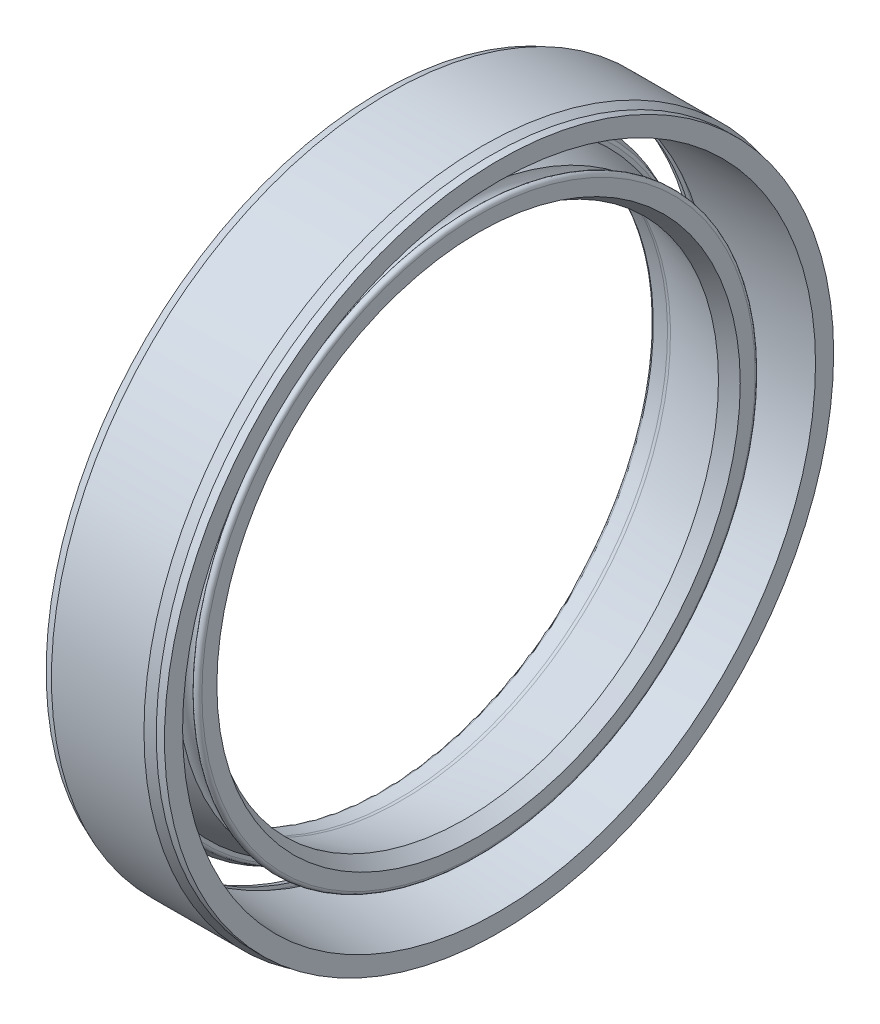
ISO-10303-21;
HEADER;
FILE_DESCRIPTION(('STEP AP214'),'2;1');
FILE_NAME('part.step','',(''),(''),'','','');
FILE_SCHEMA(('AUTOMOTIVE_DESIGN { 1 0 10303 214 1 1 1 1 }'));
ENDSEC;
DATA;
#1=APPLICATION_CONTEXT('core data for automotive mechanical design processes');
#2=APPLICATION_PROTOCOL_DEFINITION('international standard','automotive_design',2000,#1);
#3=PRODUCT_CONTEXT('',#1,'mechanical');
#4=PRODUCT('Part','Part','',(#3));
#5=PRODUCT_RELATED_PRODUCT_CATEGORY('part','',(#4));
#6=PRODUCT_DEFINITION_FORMATION('','',#4);
#7=PRODUCT_DEFINITION_CONTEXT('part definition',#1,'design');
#8=PRODUCT_DEFINITION('design','',#6,#7);
#9=PRODUCT_DEFINITION_SHAPE('','',#8);
#10=(LENGTH_UNIT() NAMED_UNIT(*) SI_UNIT(.MILLI.,.METRE.));
#11=(NAMED_UNIT(*) PLANE_ANGLE_UNIT() SI_UNIT($,.RADIAN.));
#12=(NAMED_UNIT(*) SI_UNIT($,.STERADIAN.) SOLID_ANGLE_UNIT());
#13=UNCERTAINTY_MEASURE_WITH_UNIT(LENGTH_MEASURE(1.E-05),#10,'distance_accuracy_value','');
#14=(GEOMETRIC_REPRESENTATION_CONTEXT(3) GLOBAL_UNCERTAINTY_ASSIGNED_CONTEXT((#13)) GLOBAL_UNIT_ASSIGNED_CONTEXT((#10,
#11,#12)) REPRESENTATION_CONTEXT('',''));
#15=CARTESIAN_POINT('',(0.,0.,0.));
#16=DIRECTION('',(0.,0.,1.));
#17=DIRECTION('',(1.,0.,0.));
#18=AXIS2_PLACEMENT_3D('',#15,#16,#17);
#19=CARTESIAN_POINT('',(-6.56875,0.,0.));
#20=DIRECTION('',(-1.,0.,0.));
#21=DIRECTION('',(0.,-1.,0.));
#22=AXIS2_PLACEMENT_3D('',#19,#20,#21);
#23=CONICAL_SURFACE('',#22,18.5539202,0.301266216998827);
#24=CARTESIAN_POINT('',(-7.,0.,0.));
#25=DIRECTION('',(-1.,0.,0.));
#26=DIRECTION('',(0.,-1.,0.));
#27=AXIS2_PLACEMENT_3D('',#24,#25,#26);
#28=CIRCLE('',#27,18.68792);
#29=CARTESIAN_POINT('',(-7.,-18.68792,0.));
#30=VERTEX_POINT('',#29);
#31=EDGE_CURVE('P0_E53',#30,#30,#28,.F.);
#32=ORIENTED_EDGE('',*,*,#31,.F.);
#33=EDGE_LOOP('',(#32));
#34=FACE_BOUND('',#33,.T.);
#35=CARTESIAN_POINT('',(-6.56875,0.,0.));
#36=DIRECTION('',(-1.,0.,0.));
#37=DIRECTION('',(0.,-1.,0.));
#38=AXIS2_PLACEMENT_3D('',#35,#36,#37);
#39=CIRCLE('',#38,18.5539202);
#40=CARTESIAN_POINT('',(-6.56875,-18.5539202,0.));
#41=VERTEX_POINT('',#40);
#42=EDGE_CURVE('P0_E19',#41,#41,#39,.F.);
#43=ORIENTED_EDGE('',*,*,#42,.T.);
#44=EDGE_LOOP('',(#43));
#45=FACE_BOUND('',#44,.T.);
#46=ADVANCED_FACE('P0_F15',(#34,#45),#23,.F.);
#47=CARTESIAN_POINT('',(-6.56875,0.,17.567501));
#48=DIRECTION('',(-1.,0.,0.));
#49=DIRECTION('',(0.,0.,1.));
#50=AXIS2_PLACEMENT_3D('',#47,#48,#49);
#51=PLANE('',#50);
#52=CARTESIAN_POINT('',(-6.56875,0.,0.));
#53=DIRECTION('',(-1.,0.,0.));
#54=DIRECTION('',(0.,0.,1.));
#55=AXIS2_PLACEMENT_3D('',#52,#53,#54);
#56=CIRCLE('',#55,18.760002);
#57=CARTESIAN_POINT('',(-6.56875,0.,18.760002));
#58=VERTEX_POINT('',#57);
#59=EDGE_CURVE('P0_E52',#58,#58,#56,.F.);
#60=ORIENTED_EDGE('',*,*,#59,.T.);
#61=EDGE_LOOP('',(#60));
#62=FACE_BOUND('',#61,.T.);
#63=ORIENTED_EDGE('',*,*,#42,.F.);
#64=EDGE_LOOP('',(#63));
#65=FACE_BOUND('',#64,.T.);
#66=ADVANCED_FACE('P0_F62',(#62,#65),#51,.F.);
#67=CARTESIAN_POINT('',(-7.,0.,19.239795));
#68=DIRECTION('',(-1.,0.,0.));
#69=DIRECTION('',(0.,0.,1.));
#70=AXIS2_PLACEMENT_3D('',#67,#68,#69);
#71=PLANE('',#70);
#72=ORIENTED_EDGE('',*,*,#31,.T.);
#73=EDGE_LOOP('',(#72));
#74=FACE_BOUND('',#73,.T.);
#75=CARTESIAN_POINT('',(-7.,0.,0.));
#76=DIRECTION('',(1.,0.,0.));
#77=DIRECTION('',(0.,0.,-1.));
#78=AXIS2_PLACEMENT_3D('',#75,#76,#77);
#79=CIRCLE('',#78,19.79167);
#80=CARTESIAN_POINT('',(-7.,0.,-19.79167));
#81=VERTEX_POINT('',#80);
#82=EDGE_CURVE('P0_E49',#81,#81,#79,.T.);
#83=ORIENTED_EDGE('',*,*,#82,.F.);
#84=EDGE_LOOP('',(#83));
#85=FACE_BOUND('',#84,.T.);
#86=ADVANCED_FACE('P0_F64',(#74,#85),#71,.T.);
#87=CARTESIAN_POINT('',(-5.82708499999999,0.,0.));
#88=DIRECTION('',(1.,0.,0.));
#89=DIRECTION('',(0.,1.,0.));
#90=AXIS2_PLACEMENT_3D('',#87,#88,#89);
#91=TOROIDAL_SURFACE('',#90,18.760002,0.741665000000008);
#92=ORIENTED_EDGE('',*,*,#59,.F.);
#93=EDGE_LOOP('',(#92));
#94=FACE_BOUND('',#93,.T.);
#95=CARTESIAN_POINT('',(-5.827085,0.,0.));
#96=DIRECTION('',(1.,0.,0.));
#97=DIRECTION('',(0.,0.,-1.));
#98=AXIS2_PLACEMENT_3D('',#95,#96,#97);
#99=CIRCLE('',#98,19.501667);
#100=CARTESIAN_POINT('',(-5.827085,0.,-19.501667));
#101=VERTEX_POINT('',#100);
#102=EDGE_CURVE('P0_E51',#101,#101,#99,.T.);
#103=ORIENTED_EDGE('',*,*,#102,.T.);
#104=EDGE_LOOP('',(#103));
#105=FACE_BOUND('',#104,.T.);
#106=ADVANCED_FACE('P0_F72',(#94,#105),#91,.F.);
#107=CARTESIAN_POINT('',(-6.48040001,0.,0.));
#108=DIRECTION('',(1.,0.,0.));
#109=DIRECTION('',(0.,0.,-1.));
#110=AXIS2_PLACEMENT_3D('',#107,#108,#109);
#111=CONICAL_SURFACE('',#110,20.,0.381319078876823);
#112=CARTESIAN_POINT('',(-6.48040001,0.,0.));
#113=DIRECTION('',(1.,0.,0.));
#114=DIRECTION('',(0.,0.,-1.));
#115=AXIS2_PLACEMENT_3D('',#112,#113,#114);
#116=CIRCLE('',#115,20.);
#117=CARTESIAN_POINT('',(-6.48040001,0.,-20.));
#118=VERTEX_POINT('',#117);
#119=EDGE_CURVE('P0_E48',#118,#118,#116,.T.);
#120=ORIENTED_EDGE('',*,*,#119,.F.);
#121=EDGE_LOOP('',(#120));
#122=FACE_BOUND('',#121,.T.);
#123=ORIENTED_EDGE('',*,*,#82,.T.);
#124=EDGE_LOOP('',(#123));
#125=FACE_BOUND('',#124,.T.);
#126=ADVANCED_FACE('P0_F149',(#122,#125),#111,.T.);
#127=CARTESIAN_POINT('',(-3.363541,0.,0.));
#128=DIRECTION('',(1.,0.,0.));
#129=DIRECTION('',(0.,0.,-1.));
#130=AXIS2_PLACEMENT_3D('',#127,#128,#129);
#131=CYLINDRICAL_SURFACE('',#130,19.501667);
#132=CARTESIAN_POINT('',(-0.899997,0.,0.));
#133=DIRECTION('',(1.,0.,0.));
#134=DIRECTION('',(0.,0.,-1.));
#135=AXIS2_PLACEMENT_3D('',#132,#133,#134);
#136=CIRCLE('',#135,19.501667);
#137=CARTESIAN_POINT('',(-0.899997,0.,-19.501667));
#138=VERTEX_POINT('',#137);
#139=EDGE_CURVE('P0_E45',#138,#138,#136,.T.);
#140=ORIENTED_EDGE('',*,*,#139,.T.);
#141=EDGE_LOOP('',(#140));
#142=FACE_BOUND('',#141,.T.);
#143=ORIENTED_EDGE('',*,*,#102,.F.);
#144=EDGE_LOOP('',(#143));
#145=FACE_BOUND('',#144,.T.);
#146=ADVANCED_FACE('P0_F152',(#142,#145),#131,.F.);
#147=CARTESIAN_POINT('',(-3.74325,0.,0.));
#148=DIRECTION('',(1.,0.,0.));
#149=DIRECTION('',(0.,0.,-1.));
#150=AXIS2_PLACEMENT_3D('',#147,#148,#149);
#151=CYLINDRICAL_SURFACE('',#150,20.);
#152=CARTESIAN_POINT('',(-1.00609999,0.,0.));
#153=DIRECTION('',(-1.,0.,0.));
#154=DIRECTION('',(0.,0.,1.));
#155=AXIS2_PLACEMENT_3D('',#152,#153,#154);
#156=CIRCLE('',#155,20.);
#157=CARTESIAN_POINT('',(-1.00609999,0.,20.));
#158=VERTEX_POINT('',#157);
#159=EDGE_CURVE('P0_E44',#158,#158,#156,.F.);
#160=ORIENTED_EDGE('',*,*,#159,.F.);
#161=EDGE_LOOP('',(#160));
#162=FACE_BOUND('',#161,.T.);
#163=ORIENTED_EDGE('',*,*,#119,.T.);
#164=EDGE_LOOP('',(#163));
#165=FACE_BOUND('',#164,.T.);
#166=ADVANCED_FACE('P0_F156',(#162,#165),#151,.T.);
#167=CARTESIAN_POINT('',(-0.899997,0.,19.214167));
#168=DIRECTION('',(1.,0.,0.));
#169=DIRECTION('',(0.,0.,-1.));
#170=AXIS2_PLACEMENT_3D('',#167,#168,#169);
#171=PLANE('',#170);
#172=ORIENTED_EDGE('',*,*,#139,.F.);
#173=EDGE_LOOP('',(#172));
#174=FACE_BOUND('',#173,.T.);
#175=CARTESIAN_POINT('',(-0.899997,0.,0.));
#176=DIRECTION('',(1.,0.,0.));
#177=DIRECTION('',(0.,0.,-1.));
#178=AXIS2_PLACEMENT_3D('',#175,#176,#177);
#179=CIRCLE('',#178,18.926667);
#180=CARTESIAN_POINT('',(-0.899997,0.,-18.926667));
#181=VERTEX_POINT('',#180);
#182=EDGE_CURVE('P0_E40',#181,#181,#179,.T.);
#183=ORIENTED_EDGE('',*,*,#182,.T.);
#184=EDGE_LOOP('',(#183));
#185=FACE_BOUND('',#184,.T.);
#186=ADVANCED_FACE('P0_F160',(#174,#185),#171,.F.);
#187=CARTESIAN_POINT('',(-1.00609999,0.,0.));
#188=DIRECTION('',(-1.,0.,0.));
#189=DIRECTION('',(0.,0.,1.));
#190=AXIS2_PLACEMENT_3D('',#187,#188,#189);
#191=CONICAL_SURFACE('',#190,20.,0.381319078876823);
#192=CARTESIAN_POINT('',(-0.486499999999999,0.,0.));
#193=DIRECTION('',(1.,0.,0.));
#194=DIRECTION('',(0.,0.,-1.));
#195=AXIS2_PLACEMENT_3D('',#192,#193,#194);
#196=CIRCLE('',#195,19.79167);
#197=CARTESIAN_POINT('',(-0.486499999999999,0.,-19.79167));
#198=VERTEX_POINT('',#197);
#199=EDGE_CURVE('P0_E43',#198,#198,#196,.T.);
#200=ORIENTED_EDGE('',*,*,#199,.F.);
#201=EDGE_LOOP('',(#200));
#202=FACE_BOUND('',#201,.T.);
#203=ORIENTED_EDGE('',*,*,#159,.T.);
#204=EDGE_LOOP('',(#203));
#205=FACE_BOUND('',#204,.T.);
#206=ADVANCED_FACE('P0_F164',(#202,#205),#191,.T.);
#207=CARTESIAN_POINT('',(-5.827085,0.,0.));
#208=DIRECTION('',(1.,0.,0.));
#209=DIRECTION('',(0.,0.,-1.));
#210=AXIS2_PLACEMENT_3D('',#207,#208,#209);
#211=CYLINDRICAL_SURFACE('',#210,18.926667);
#212=CARTESIAN_POINT('',(-5.827085,0.,0.));
#213=DIRECTION('',(1.,0.,0.));
#214=DIRECTION('',(0.,1.,0.));
#215=AXIS2_PLACEMENT_3D('',#212,#213,#214);
#216=CIRCLE('',#215,18.926667);
#217=CARTESIAN_POINT('',(-5.827085,18.926667,0.));
#218=VERTEX_POINT('',#217);
#219=EDGE_CURVE('P0_E39',#218,#218,#216,.T.);
#220=ORIENTED_EDGE('',*,*,#219,.T.);
#221=EDGE_LOOP('',(#220));
#222=FACE_BOUND('',#221,.T.);
#223=ORIENTED_EDGE('',*,*,#182,.F.);
#224=EDGE_LOOP('',(#223));
#225=FACE_BOUND('',#224,.T.);
#226=ADVANCED_FACE('P0_F168',(#222,#225),#211,.T.);
#227=CARTESIAN_POINT('',(-0.24325,0.,0.));
#228=DIRECTION('',(1.,0.,0.));
#229=DIRECTION('',(0.,0.,-1.));
#230=AXIS2_PLACEMENT_3D('',#227,#228,#229);
#231=CYLINDRICAL_SURFACE('',#230,19.79167);
#232=CARTESIAN_POINT('',(0.,0.,0.));
#233=DIRECTION('',(1.,0.,0.));
#234=DIRECTION('',(0.,0.,-1.));
#235=AXIS2_PLACEMENT_3D('',#232,#233,#234);
#236=CIRCLE('',#235,19.79167);
#237=CARTESIAN_POINT('',(0.,0.,-19.79167));
#238=VERTEX_POINT('',#237);
#239=EDGE_CURVE('P0_E36',#238,#238,#236,.T.);
#240=ORIENTED_EDGE('',*,*,#239,.F.);
#241=EDGE_LOOP('',(#240));
#242=FACE_BOUND('',#241,.T.);
#243=ORIENTED_EDGE('',*,*,#199,.T.);
#244=EDGE_LOOP('',(#243));
#245=FACE_BOUND('',#244,.T.);
#246=ADVANCED_FACE('P0_F94',(#242,#245),#231,.T.);
#247=CARTESIAN_POINT('',(-5.827085,0.,0.));
#248=DIRECTION('',(1.,0.,0.));
#249=DIRECTION('',(0.,1.,0.));
#250=AXIS2_PLACEMENT_3D('',#247,#248,#249);
#251=TOROIDAL_SURFACE('',#250,18.760002,0.166664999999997);
#252=ORIENTED_EDGE('',*,*,#219,.F.);
#253=EDGE_LOOP('',(#252));
#254=FACE_BOUND('',#253,.T.);
#255=CARTESIAN_POINT('',(-5.99375,0.,0.));
#256=DIRECTION('',(1.,0.,0.));
#257=DIRECTION('',(0.,0.,1.));
#258=AXIS2_PLACEMENT_3D('',#255,#256,#257);
#259=CIRCLE('',#258,18.760002);
#260=CARTESIAN_POINT('',(-5.99375,0.,18.760002));
#261=VERTEX_POINT('',#260);
#262=EDGE_CURVE('P0_E28',#261,#261,#259,.T.);
#263=ORIENTED_EDGE('',*,*,#262,.T.);
#264=EDGE_LOOP('',(#263));
#265=FACE_BOUND('',#264,.T.);
#266=ADVANCED_FACE('P0_F88',(#254,#265),#251,.T.);
#267=CARTESIAN_POINT('',(0.,0.,19.25583675));
#268=DIRECTION('',(1.,0.,0.));
#269=DIRECTION('',(0.,0.,-1.));
#270=AXIS2_PLACEMENT_3D('',#267,#268,#269);
#271=PLANE('',#270);
#272=ORIENTED_EDGE('',*,*,#239,.T.);
#273=EDGE_LOOP('',(#272));
#274=FACE_BOUND('',#273,.T.);
#275=CARTESIAN_POINT('',(0.,0.,0.));
#276=DIRECTION('',(1.,0.,0.));
#277=DIRECTION('',(0.,0.,-1.));
#278=AXIS2_PLACEMENT_3D('',#275,#276,#277);
#279=CIRCLE('',#278,18.7200035);
#280=CARTESIAN_POINT('',(0.,0.,-18.7200035));
#281=VERTEX_POINT('',#280);
#282=EDGE_CURVE('P0_E23',#281,#281,#279,.T.);
#283=ORIENTED_EDGE('',*,*,#282,.F.);
#284=EDGE_LOOP('',(#283));
#285=FACE_BOUND('',#284,.T.);
#286=ADVANCED_FACE('P0_F83',(#274,#285),#271,.T.);
#287=CARTESIAN_POINT('',(-5.99375,0.,17.567501));
#288=DIRECTION('',(1.,0.,0.));
#289=DIRECTION('',(0.,0.,-1.));
#290=AXIS2_PLACEMENT_3D('',#287,#288,#289);
#291=PLANE('',#290);
#292=ORIENTED_EDGE('',*,*,#262,.F.);
#293=EDGE_LOOP('',(#292));
#294=FACE_BOUND('',#293,.T.);
#295=CARTESIAN_POINT('',(-5.99375,0.,0.));
#296=DIRECTION('',(1.,0.,0.));
#297=DIRECTION('',(0.,0.,-1.));
#298=AXIS2_PLACEMENT_3D('',#295,#296,#297);
#299=CIRCLE('',#298,18.464587);
#300=CARTESIAN_POINT('',(-5.99375,0.,-18.464587));
#301=VERTEX_POINT('',#300);
#302=EDGE_CURVE('P0_E10',#301,#301,#299,.F.);
#303=ORIENTED_EDGE('',*,*,#302,.F.);
#304=EDGE_LOOP('',(#303));
#305=FACE_BOUND('',#304,.T.);
#306=ADVANCED_FACE('P0_F78',(#294,#305),#291,.F.);
#307=CARTESIAN_POINT('',(-5.99375000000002,0.,0.));
#308=DIRECTION('',(1.,0.,0.));
#309=DIRECTION('',(0.,0.,-1.));
#310=AXIS2_PLACEMENT_3D('',#307,#308,#309);
#311=CONICAL_SURFACE('',#310,18.464587,0.0425880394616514);
#312=ORIENTED_EDGE('',*,*,#282,.T.);
#313=EDGE_LOOP('',(#312));
#314=FACE_BOUND('',#313,.T.);
#315=ORIENTED_EDGE('',*,*,#302,.T.);
#316=EDGE_LOOP('',(#315));
#317=FACE_BOUND('',#316,.T.);
#318=ADVANCED_FACE('P0_F17',(#314,#317),#311,.F.);
#319=CLOSED_SHELL('',(#46,#66,#86,#106,#126,#146,#166,#186,#206,#226,#246,#266,#286,#306,#318));
#320=MANIFOLD_SOLID_BREP('P0_B1',#319);
#321=CARTESIAN_POINT('',(-7.,0.,16.3708665));
#322=DIRECTION('',(-1.,0.,0.));
#323=DIRECTION('',(0.,0.,1.));
#324=AXIS2_PLACEMENT_3D('',#321,#322,#323);
#325=PLANE('',#324);
#326=CARTESIAN_POINT('',(-7.,0.,0.));
#327=DIRECTION('',(-1.,0.,0.));
#328=DIRECTION('',(0.,0.,1.));
#329=AXIS2_PLACEMENT_3D('',#326,#327,#328);
#330=CIRCLE('',#329,16.124983);
#331=CARTESIAN_POINT('',(-7.,0.,16.124983));
#332=VERTEX_POINT('',#331);
#333=EDGE_CURVE('P1_E155',#332,#332,#330,.T.);
#334=ORIENTED_EDGE('',*,*,#333,.F.);
#335=EDGE_LOOP('',(#334));
#336=FACE_BOUND('',#335,.T.);
#337=CARTESIAN_POINT('',(-7.,0.,0.));
#338=DIRECTION('',(1.,0.,0.));
#339=DIRECTION('',(0.,0.,-1.));
#340=AXIS2_PLACEMENT_3D('',#337,#338,#339);
#341=CIRCLE('',#340,16.61675);
#342=CARTESIAN_POINT('',(-7.,0.,-16.61675));
#343=VERTEX_POINT('',#342);
#344=EDGE_CURVE('P1_E21',#343,#343,#341,.T.);
#345=ORIENTED_EDGE('',*,*,#344,.F.);
#346=EDGE_LOOP('',(#345));
#347=FACE_BOUND('',#346,.T.);
#348=ADVANCED_FACE('P1_F15',(#336,#347),#325,.T.);
#349=CARTESIAN_POINT('',(-6.83335,0.,0.));
#350=DIRECTION('',(1.,0.,0.));
#351=DIRECTION('',(0.,1.,0.));
#352=AXIS2_PLACEMENT_3D('',#349,#350,#351);
#353=TOROIDAL_SURFACE('',#352,16.124983,0.166650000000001);
#354=CARTESIAN_POINT('',(-6.83335,0.,0.));
#355=DIRECTION('',(-1.,0.,0.));
#356=DIRECTION('',(0.,0.,1.));
#357=AXIS2_PLACEMENT_3D('',#354,#355,#356);
#358=CIRCLE('',#357,15.958333);
#359=CARTESIAN_POINT('',(-6.83335,0.,15.958333));
#360=VERTEX_POINT('',#359);
#361=EDGE_CURVE('P1_E145',#360,#360,#358,.T.);
#362=ORIENTED_EDGE('',*,*,#361,.F.);
#363=EDGE_LOOP('',(#362));
#364=FACE_BOUND('',#363,.T.);
#365=ORIENTED_EDGE('',*,*,#333,.T.);
#366=EDGE_LOOP('',(#365));
#367=FACE_BOUND('',#366,.T.);
#368=ADVANCED_FACE('P1_F220',(#364,#367),#353,.T.);
#369=CARTESIAN_POINT('',(-6.56875,0.,0.));
#370=DIRECTION('',(1.,0.,0.));
#371=DIRECTION('',(0.,0.,-1.));
#372=AXIS2_PLACEMENT_3D('',#369,#370,#371);
#373=CONICAL_SURFACE('',#372,16.75075,0.30126663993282);
#374=ORIENTED_EDGE('',*,*,#344,.T.);
#375=EDGE_LOOP('',(#374));
#376=FACE_BOUND('',#375,.T.);
#377=CARTESIAN_POINT('',(-6.56875,0.,0.));
#378=DIRECTION('',(1.,0.,0.));
#379=DIRECTION('',(0.,0.,-1.));
#380=AXIS2_PLACEMENT_3D('',#377,#378,#379);
#381=CIRCLE('',#380,16.75075);
#382=CARTESIAN_POINT('',(-6.56875,0.,-16.75075));
#383=VERTEX_POINT('',#382);
#384=EDGE_CURVE('P1_E143',#383,#383,#381,.F.);
#385=ORIENTED_EDGE('',*,*,#384,.T.);
#386=EDGE_LOOP('',(#385));
#387=FACE_BOUND('',#386,.T.);
#388=ADVANCED_FACE('P1_F237',(#376,#387),#373,.T.);
#389=CARTESIAN_POINT('',(-6.83335,0.,0.));
#390=DIRECTION('',(1.,0.,0.));
#391=DIRECTION('',(0.,0.,-1.));
#392=AXIS2_PLACEMENT_3D('',#389,#390,#391);
#393=CYLINDRICAL_SURFACE('',#392,15.958333);
#394=ORIENTED_EDGE('',*,*,#361,.T.);
#395=EDGE_LOOP('',(#394));
#396=FACE_BOUND('',#395,.T.);
#397=CARTESIAN_POINT('',(-5.99375000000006,0.,0.));
#398=DIRECTION('',(1.,0.,0.));
#399=DIRECTION('',(0.,1.,0.));
#400=AXIS2_PLACEMENT_3D('',#397,#398,#399);
#401=CIRCLE('',#400,15.958333);
#402=CARTESIAN_POINT('',(-5.99375000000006,15.958333,0.));
#403=VERTEX_POINT('',#402);
#404=EDGE_CURVE('P1_E142',#403,#403,#401,.F.);
#405=ORIENTED_EDGE('',*,*,#404,.F.);
#406=EDGE_LOOP('',(#405));
#407=FACE_BOUND('',#406,.T.);
#408=ADVANCED_FACE('P1_F240',(#396,#407),#393,.F.);
#409=CARTESIAN_POINT('',(-6.56875,0.,17.567501));
#410=DIRECTION('',(-1.,0.,0.));
#411=DIRECTION('',(0.,0.,1.));
#412=AXIS2_PLACEMENT_3D('',#409,#410,#411);
#413=PLANE('',#412);
#414=CARTESIAN_POINT('',(-6.56875,0.,0.));
#415=DIRECTION('',(1.,0.,0.));
#416=DIRECTION('',(0.,0.,-1.));
#417=AXIS2_PLACEMENT_3D('',#414,#415,#416);
#418=CIRCLE('',#417,16.375);
#419=CARTESIAN_POINT('',(-6.56875,0.,-16.375));
#420=VERTEX_POINT('',#419);
#421=EDGE_CURVE('P1_E140',#420,#420,#418,.F.);
#422=ORIENTED_EDGE('',*,*,#421,.T.);
#423=EDGE_LOOP('',(#422));
#424=FACE_BOUND('',#423,.T.);
#425=ORIENTED_EDGE('',*,*,#384,.F.);
#426=EDGE_LOOP('',(#425));
#427=FACE_BOUND('',#426,.T.);
#428=ADVANCED_FACE('P1_F168',(#424,#427),#413,.F.);
#429=CARTESIAN_POINT('',(-5.99375000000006,0.,0.));
#430=DIRECTION('',(1.,0.,0.));
#431=DIRECTION('',(0.,1.,0.));
#432=AXIS2_PLACEMENT_3D('',#429,#430,#431);
#433=TOROIDAL_SURFACE('',#432,15.1249999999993,0.833333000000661);
#434=CARTESIAN_POINT('',(-5.79345776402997,0.,0.));
#435=DIRECTION('',(-1.,0.,0.));
#436=DIRECTION('',(0.,0.,1.));
#437=AXIS2_PLACEMENT_3D('',#434,#435,#436);
#438=CIRCLE('',#437,15.9339047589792);
#439=CARTESIAN_POINT('',(-5.79345776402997,0.,15.9339047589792));
#440=VERTEX_POINT('',#439);
#441=EDGE_CURVE('P1_E139',#440,#440,#438,.T.);
#442=ORIENTED_EDGE('',*,*,#441,.F.);
#443=EDGE_LOOP('',(#442));
#444=FACE_BOUND('',#443,.T.);
#445=ORIENTED_EDGE('',*,*,#404,.T.);
#446=EDGE_LOOP('',(#445));
#447=FACE_BOUND('',#446,.T.);
#448=ADVANCED_FACE('P1_F163',(#444,#447),#433,.F.);
#449=CARTESIAN_POINT('',(-6.56875,0.,0.));
#450=DIRECTION('',(1.,0.,0.));
#451=DIRECTION('',(0.,0.,-1.));
#452=AXIS2_PLACEMENT_3D('',#449,#450,#451);
#453=CYLINDRICAL_SURFACE('',#452,16.375);
#454=ORIENTED_EDGE('',*,*,#421,.F.);
#455=EDGE_LOOP('',(#454));
#456=FACE_BOUND('',#455,.T.);
#457=CARTESIAN_POINT('',(-5.99375,0.,0.));
#458=DIRECTION('',(1.,0.,0.));
#459=DIRECTION('',(0.,0.,-1.));
#460=AXIS2_PLACEMENT_3D('',#457,#458,#459);
#461=CIRCLE('',#460,16.375);
#462=CARTESIAN_POINT('',(-5.99375,0.,-16.375));
#463=VERTEX_POINT('',#462);
#464=EDGE_CURVE('P1_E136',#463,#463,#461,.F.);
#465=ORIENTED_EDGE('',*,*,#464,.T.);
#466=EDGE_LOOP('',(#465));
#467=FACE_BOUND('',#466,.T.);
#468=ADVANCED_FACE('P1_F167',(#456,#467),#453,.T.);
#469=CARTESIAN_POINT('',(-2.02176886,0.,0.));
#470=DIRECTION('',(-1.,0.,0.));
#471=DIRECTION('',(0.,0.,1.));
#472=AXIS2_PLACEMENT_3D('',#469,#470,#471);
#473=CONICAL_SURFACE('',#472,15.0000001,0.242727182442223);
#474=ORIENTED_EDGE('',*,*,#441,.T.);
#475=EDGE_LOOP('',(#474));
#476=FACE_BOUND('',#475,.T.);
#477=CARTESIAN_POINT('',(-2.02176886,0.,0.));
#478=DIRECTION('',(1.,0.,0.));
#479=DIRECTION('',(0.,0.,1.));
#480=AXIS2_PLACEMENT_3D('',#477,#478,#479);
#481=CIRCLE('',#480,15.0000001);
#482=CARTESIAN_POINT('',(-2.02176886,0.,15.0000001));
#483=VERTEX_POINT('',#482);
#484=EDGE_CURVE('P1_E135',#483,#483,#481,.F.);
#485=ORIENTED_EDGE('',*,*,#484,.F.);
#486=EDGE_LOOP('',(#485));
#487=FACE_BOUND('',#486,.T.);
#488=ADVANCED_FACE('P1_F173',(#476,#487),#473,.F.);
#489=CARTESIAN_POINT('',(-5.99375,0.,17.567501));
#490=DIRECTION('',(1.,0.,0.));
#491=DIRECTION('',(0.,0.,-1.));
#492=AXIS2_PLACEMENT_3D('',#489,#490,#491);
#493=PLANE('',#492);
#494=ORIENTED_EDGE('',*,*,#464,.F.);
#495=EDGE_LOOP('',(#494));
#496=FACE_BOUND('',#495,.T.);
#497=CARTESIAN_POINT('',(-5.99375,0.,0.));
#498=DIRECTION('',(-1.,0.,0.));
#499=DIRECTION('',(0.,0.,1.));
#500=AXIS2_PLACEMENT_3D('',#497,#498,#499);
#501=CIRCLE('',#500,17.35225);
#502=CARTESIAN_POINT('',(-5.99375,0.,17.35225));
#503=VERTEX_POINT('',#502);
#504=EDGE_CURVE('P1_E132',#503,#503,#501,.F.);
#505=ORIENTED_EDGE('',*,*,#504,.F.);
#506=EDGE_LOOP('',(#505));
#507=FACE_BOUND('',#506,.T.);
#508=ADVANCED_FACE('P1_F177',(#496,#507),#493,.F.);
#509=CARTESIAN_POINT('',(-2.02176886,0.,0.));
#510=DIRECTION('',(1.,0.,0.));
#511=DIRECTION('',(0.,0.,-1.));
#512=AXIS2_PLACEMENT_3D('',#509,#510,#511);
#513=CONICAL_SURFACE('',#512,15.0000001,0.535441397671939);
#514=ORIENTED_EDGE('',*,*,#484,.T.);
#515=EDGE_LOOP('',(#514));
#516=FACE_BOUND('',#515,.T.);
#517=CARTESIAN_POINT('',(-1.212669,0.,0.));
#518=DIRECTION('',(1.,0.,0.));
#519=DIRECTION('',(0.,0.,-1.));
#520=AXIS2_PLACEMENT_3D('',#517,#518,#519);
#521=CIRCLE('',#520,15.4799985);
#522=CARTESIAN_POINT('',(-1.212669,0.,-15.4799985));
#523=VERTEX_POINT('',#522);
#524=EDGE_CURVE('P1_E128',#523,#523,#521,.F.);
#525=ORIENTED_EDGE('',*,*,#524,.F.);
#526=EDGE_LOOP('',(#525));
#527=FACE_BOUND('',#526,.T.);
#528=ADVANCED_FACE('P1_F181',(#516,#527),#513,.F.);
#529=CARTESIAN_POINT('',(-5.99375,0.,0.));
#530=DIRECTION('',(-1.,0.,0.));
#531=DIRECTION('',(0.,0.,1.));
#532=AXIS2_PLACEMENT_3D('',#529,#530,#531);
#533=CONICAL_SURFACE('',#532,17.35225,0.385103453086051);
#534=CARTESIAN_POINT('',(-5.4571667,0.,0.));
#535=DIRECTION('',(1.,0.,0.));
#536=DIRECTION('',(0.,1.,0.));
#537=AXIS2_PLACEMENT_3D('',#534,#535,#536);
#538=CIRCLE('',#537,17.13475);
#539=CARTESIAN_POINT('',(-5.4571667,17.13475,0.));
#540=VERTEX_POINT('',#539);
#541=EDGE_CURVE('P1_E131',#540,#540,#538,.T.);
#542=ORIENTED_EDGE('',*,*,#541,.F.);
#543=EDGE_LOOP('',(#542));
#544=FACE_BOUND('',#543,.T.);
#545=ORIENTED_EDGE('',*,*,#504,.T.);
#546=EDGE_LOOP('',(#545));
#547=FACE_BOUND('',#546,.T.);
#548=ADVANCED_FACE('P1_F185',(#544,#547),#533,.T.);
#549=CARTESIAN_POINT('',(-1.212669,0.,15.92208175));
#550=DIRECTION('',(1.,0.,0.));
#551=DIRECTION('',(0.,0.,-1.));
#552=AXIS2_PLACEMENT_3D('',#549,#550,#551);
#553=PLANE('',#552);
#554=CARTESIAN_POINT('',(-1.212669,0.,0.));
#555=DIRECTION('',(-1.,0.,0.));
#556=DIRECTION('',(0.,0.,1.));
#557=AXIS2_PLACEMENT_3D('',#554,#555,#556);
#558=CIRCLE('',#557,16.364165);
#559=CARTESIAN_POINT('',(-1.212669,0.,16.364165));
#560=VERTEX_POINT('',#559);
#561=EDGE_CURVE('P1_E202',#560,#560,#558,.T.);
#562=ORIENTED_EDGE('',*,*,#561,.F.);
#563=EDGE_LOOP('',(#562));
#564=FACE_BOUND('',#563,.T.);
#565=ORIENTED_EDGE('',*,*,#524,.T.);
#566=EDGE_LOOP('',(#565));
#567=FACE_BOUND('',#566,.T.);
#568=ADVANCED_FACE('P1_F188',(#564,#567),#553,.T.);
#569=CARTESIAN_POINT('',(-5.53542803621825,0.,0.));
#570=DIRECTION('',(1.,0.,0.));
#571=DIRECTION('',(0.,1.,0.));
#572=AXIS2_PLACEMENT_3D('',#569,#570,#571);
#573=TOROIDAL_SURFACE('',#572,16.9416753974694,0.208333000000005);
#574=ORIENTED_EDGE('',*,*,#541,.T.);
#575=EDGE_LOOP('',(#574));
#576=FACE_BOUND('',#575,.T.);
#577=CARTESIAN_POINT('',(-5.32709503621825,0.,0.));
#578=DIRECTION('',(-1.,0.,0.));
#579=DIRECTION('',(0.,0.,1.));
#580=AXIS2_PLACEMENT_3D('',#577,#578,#579);
#581=CIRCLE('',#580,16.9416753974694);
#582=CARTESIAN_POINT('',(-5.32709503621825,0.,16.9416753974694));
#583=VERTEX_POINT('',#582);
#584=EDGE_CURVE('P1_E73',#583,#583,#581,.F.);
#585=ORIENTED_EDGE('',*,*,#584,.F.);
#586=EDGE_LOOP('',(#585));
#587=FACE_BOUND('',#586,.T.);
#588=ADVANCED_FACE('P1_F59',(#576,#587),#573,.T.);
#589=CARTESIAN_POINT('',(-1.4318355,0.,0.));
#590=DIRECTION('',(1.,0.,0.));
#591=DIRECTION('',(0.,1.,0.));
#592=AXIS2_PLACEMENT_3D('',#589,#590,#591);
#593=TOROIDAL_SURFACE('',#592,16.364165,0.2191665);
#594=CARTESIAN_POINT('',(-1.651002,0.,0.));
#595=DIRECTION('',(1.,0.,0.));
#596=DIRECTION('',(0.,0.,1.));
#597=AXIS2_PLACEMENT_3D('',#594,#595,#596);
#598=CIRCLE('',#597,16.364165);
#599=CARTESIAN_POINT('',(-1.651002,0.,16.364165));
#600=VERTEX_POINT('',#599);
#601=EDGE_CURVE('P1_E40',#600,#600,#598,.F.);
#602=ORIENTED_EDGE('',*,*,#601,.F.);
#603=EDGE_LOOP('',(#602));
#604=FACE_BOUND('',#603,.T.);
#605=ORIENTED_EDGE('',*,*,#561,.T.);
#606=EDGE_LOOP('',(#605));
#607=FACE_BOUND('',#606,.T.);
#608=ADVANCED_FACE('P1_F47',(#604,#607),#593,.T.);
#609=CARTESIAN_POINT('',(-5.32709503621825,0.,16.8321337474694));
#610=DIRECTION('',(1.,0.,0.));
#611=DIRECTION('',(0.,0.,-1.));
#612=AXIS2_PLACEMENT_3D('',#609,#610,#611);
#613=PLANE('',#612);
#614=ORIENTED_EDGE('',*,*,#584,.T.);
#615=EDGE_LOOP('',(#614));
#616=FACE_BOUND('',#615,.T.);
#617=CARTESIAN_POINT('',(-5.32709503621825,0.,0.));
#618=DIRECTION('',(-1.,0.,0.));
#619=DIRECTION('',(0.,0.,1.));
#620=AXIS2_PLACEMENT_3D('',#617,#618,#619);
#621=CIRCLE('',#620,16.7225920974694);
#622=CARTESIAN_POINT('',(-5.32709503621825,0.,16.7225920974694));
#623=VERTEX_POINT('',#622);
#624=EDGE_CURVE('P1_E30',#623,#623,#621,.F.);
#625=ORIENTED_EDGE('',*,*,#624,.F.);
#626=EDGE_LOOP('',(#625));
#627=FACE_BOUND('',#626,.T.);
#628=ADVANCED_FACE('P1_F58',(#616,#627),#613,.T.);
#629=CARTESIAN_POINT('',(-1.651002,0.,16.265415));
#630=DIRECTION('',(-1.,0.,0.));
#631=DIRECTION('',(0.,0.,1.));
#632=AXIS2_PLACEMENT_3D('',#629,#630,#631);
#633=PLANE('',#632);
#634=CARTESIAN_POINT('',(-1.651002,0.,0.));
#635=DIRECTION('',(-1.,0.,0.));
#636=DIRECTION('',(0.,0.,1.));
#637=AXIS2_PLACEMENT_3D('',#634,#635,#636);
#638=CIRCLE('',#637,16.166665);
#639=CARTESIAN_POINT('',(-1.651002,0.,16.166665));
#640=VERTEX_POINT('',#639);
#641=EDGE_CURVE('P1_E25',#640,#640,#638,.T.);
#642=ORIENTED_EDGE('',*,*,#641,.F.);
#643=EDGE_LOOP('',(#642));
#644=FACE_BOUND('',#643,.T.);
#645=ORIENTED_EDGE('',*,*,#601,.T.);
#646=EDGE_LOOP('',(#645));
#647=FACE_BOUND('',#646,.T.);
#648=ADVANCED_FACE('P1_F89',(#644,#647),#633,.T.);
#649=CARTESIAN_POINT('',(-5.32709503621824,0.,0.));
#650=DIRECTION('',(-1.,0.,0.));
#651=DIRECTION('',(0.,0.,1.));
#652=AXIS2_PLACEMENT_3D('',#649,#650,#651);
#653=CONICAL_SURFACE('',#652,16.7225920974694,0.225256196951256);
#654=CARTESIAN_POINT('',(-2.901002,0.,0.));
#655=DIRECTION('',(1.,0.,0.));
#656=DIRECTION('',(0.,1.,0.));
#657=AXIS2_PLACEMENT_3D('',#654,#655,#656);
#658=CIRCLE('',#657,16.166665);
#659=CARTESIAN_POINT('',(-2.901002,16.166665,0.));
#660=VERTEX_POINT('',#659);
#661=EDGE_CURVE('P1_E10',#660,#660,#658,.T.);
#662=ORIENTED_EDGE('',*,*,#661,.F.);
#663=EDGE_LOOP('',(#662));
#664=FACE_BOUND('',#663,.T.);
#665=ORIENTED_EDGE('',*,*,#624,.T.);
#666=EDGE_LOOP('',(#665));
#667=FACE_BOUND('',#666,.T.);
#668=ADVANCED_FACE('P1_F97',(#664,#667),#653,.T.);
#669=CARTESIAN_POINT('',(-2.276002,0.,0.));
#670=DIRECTION('',(1.,0.,0.));
#671=DIRECTION('',(0.,1.,0.));
#672=AXIS2_PLACEMENT_3D('',#669,#670,#671);
#673=TOROIDAL_SURFACE('',#672,16.166665,0.625);
#674=ORIENTED_EDGE('',*,*,#661,.T.);
#675=EDGE_LOOP('',(#674));
#676=FACE_BOUND('',#675,.T.);
#677=ORIENTED_EDGE('',*,*,#641,.T.);
#678=EDGE_LOOP('',(#677));
#679=FACE_BOUND('',#678,.T.);
#680=ADVANCED_FACE('P1_F17',(#676,#679),#673,.F.);
#681=CLOSED_SHELL('',(#348,#368,#388,#408,#428,#448,#468,#488,#508,#528,#548,#568,#588,#608,
#628,#648,#668,#680));
#682=MANIFOLD_SOLID_BREP('P1_B1',#681);
#683=ADVANCED_BREP_SHAPE_REPRESENTATION('',(#18,#320,#682),#14);
#684=SHAPE_DEFINITION_REPRESENTATION(#9,#683);
ENDSEC;
END-ISO-10303-21;
